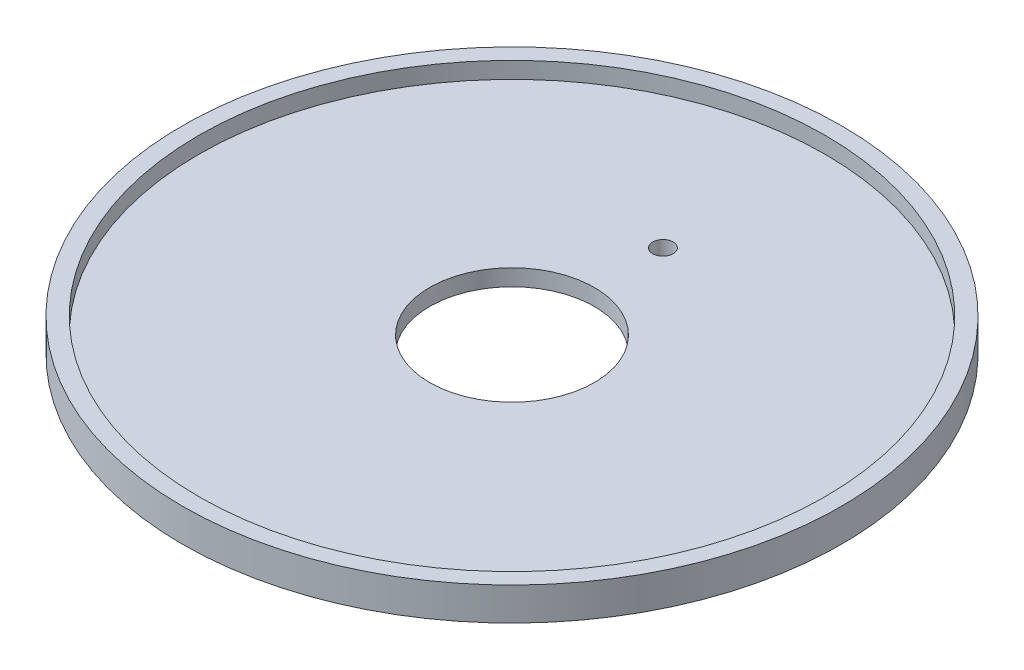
ISO-10303-21;
HEADER;
FILE_DESCRIPTION(('STEP AP214'),'2;1');
FILE_NAME('part.step','',(''),(''),'','','');
FILE_SCHEMA(('AUTOMOTIVE_DESIGN { 1 0 10303 214 1 1 1 1 }'));
ENDSEC;
DATA;
#1=APPLICATION_CONTEXT('core data for automotive mechanical design processes');
#2=APPLICATION_PROTOCOL_DEFINITION('international standard','automotive_design',2000,#1);
#3=PRODUCT_CONTEXT('',#1,'mechanical');
#4=PRODUCT('Part','Part','',(#3));
#5=PRODUCT_RELATED_PRODUCT_CATEGORY('part','',(#4));
#6=PRODUCT_DEFINITION_FORMATION('','',#4);
#7=PRODUCT_DEFINITION_CONTEXT('part definition',#1,'design');
#8=PRODUCT_DEFINITION('design','',#6,#7);
#9=PRODUCT_DEFINITION_SHAPE('','',#8);
#10=(LENGTH_UNIT() NAMED_UNIT(*) SI_UNIT(.MILLI.,.METRE.));
#11=(NAMED_UNIT(*) PLANE_ANGLE_UNIT() SI_UNIT($,.RADIAN.));
#12=(NAMED_UNIT(*) SI_UNIT($,.STERADIAN.) SOLID_ANGLE_UNIT());
#13=UNCERTAINTY_MEASURE_WITH_UNIT(LENGTH_MEASURE(1.E-05),#10,'distance_accuracy_value','');
#14=(GEOMETRIC_REPRESENTATION_CONTEXT(3) GLOBAL_UNCERTAINTY_ASSIGNED_CONTEXT((#13)) GLOBAL_UNIT_ASSIGNED_CONTEXT((#10,
#11,#12)) REPRESENTATION_CONTEXT('',''));
#15=CARTESIAN_POINT('',(0.,0.,0.));
#16=DIRECTION('',(0.,0.,1.));
#17=DIRECTION('',(1.,0.,0.));
#18=AXIS2_PLACEMENT_3D('',#15,#16,#17);
#19=CARTESIAN_POINT('',(0.,5.,0.));
#20=DIRECTION('',(0.,1.,0.));
#21=DIRECTION('',(0.,0.,1.));
#22=AXIS2_PLACEMENT_3D('',#19,#20,#21);
#23=PLANE('',#22);
#24=CARTESIAN_POINT('',(0.,5.,-45.8));
#25=DIRECTION('',(0.,1.,0.));
#26=DIRECTION('',(0.,0.,1.));
#27=AXIS2_PLACEMENT_3D('',#24,#25,#26);
#28=CIRCLE('',#27,3.10140403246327);
#29=CARTESIAN_POINT('',(0.,5.,-42.6985959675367));
#30=VERTEX_POINT('',#29);
#31=EDGE_CURVE('E72',#30,#30,#28,.T.);
#32=ORIENTED_EDGE('',*,*,#31,.F.);
#33=EDGE_LOOP('',(#32));
#34=FACE_BOUND('',#33,.T.);
#35=CARTESIAN_POINT('',(0.,5.,0.));
#36=DIRECTION('',(0.,1.,0.));
#37=DIRECTION('',(0.,0.,1.));
#38=AXIS2_PLACEMENT_3D('',#35,#36,#37);
#39=CIRCLE('',#38,25.);
#40=CARTESIAN_POINT('',(0.,5.,25.));
#41=VERTEX_POINT('',#40);
#42=EDGE_CURVE('E54',#41,#41,#39,.T.);
#43=ORIENTED_EDGE('',*,*,#42,.F.);
#44=EDGE_LOOP('',(#43));
#45=FACE_BOUND('',#44,.T.);
#46=CARTESIAN_POINT('',(0.,5.,0.));
#47=DIRECTION('',(0.,1.,0.));
#48=DIRECTION('',(0.,0.,1.));
#49=AXIS2_PLACEMENT_3D('',#46,#47,#48);
#50=CIRCLE('',#49,95.);
#51=CARTESIAN_POINT('',(0.,5.,95.));
#52=VERTEX_POINT('',#51);
#53=EDGE_CURVE('E10',#52,#52,#50,.F.);
#54=ORIENTED_EDGE('',*,*,#53,.F.);
#55=EDGE_LOOP('',(#54));
#56=FACE_BOUND('',#55,.T.);
#57=ADVANCED_FACE('F40',(#34,#45,#56),#23,.T.);
#58=CARTESIAN_POINT('',(0.,0.,0.));
#59=DIRECTION('',(0.,1.,0.));
#60=DIRECTION('',(0.,0.,1.));
#61=AXIS2_PLACEMENT_3D('',#58,#59,#60);
#62=PLANE('',#61);
#63=CARTESIAN_POINT('',(0.,0.,-45.8));
#64=DIRECTION('',(0.,1.,0.));
#65=DIRECTION('',(0.,0.,1.));
#66=AXIS2_PLACEMENT_3D('',#63,#64,#65);
#67=CIRCLE('',#66,3.10140403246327);
#68=CARTESIAN_POINT('',(0.,0.,-42.6985959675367));
#69=VERTEX_POINT('',#68);
#70=EDGE_CURVE('E44',#69,#69,#67,.T.);
#71=ORIENTED_EDGE('',*,*,#70,.T.);
#72=EDGE_LOOP('',(#71));
#73=FACE_BOUND('',#72,.T.);
#74=CARTESIAN_POINT('',(0.,0.,0.));
#75=DIRECTION('',(0.,1.,0.));
#76=DIRECTION('',(0.,0.,1.));
#77=AXIS2_PLACEMENT_3D('',#74,#75,#76);
#78=CIRCLE('',#77,100.);
#79=CARTESIAN_POINT('',(0.,0.,100.));
#80=VERTEX_POINT('',#79);
#81=EDGE_CURVE('E49',#80,#80,#78,.T.);
#82=ORIENTED_EDGE('',*,*,#81,.F.);
#83=EDGE_LOOP('',(#82));
#84=FACE_BOUND('',#83,.T.);
#85=CARTESIAN_POINT('',(0.,0.,0.));
#86=DIRECTION('',(0.,1.,0.));
#87=DIRECTION('',(0.,0.,1.));
#88=AXIS2_PLACEMENT_3D('',#85,#86,#87);
#89=CIRCLE('',#88,25.);
#90=CARTESIAN_POINT('',(0.,0.,25.));
#91=VERTEX_POINT('',#90);
#92=EDGE_CURVE('E57',#91,#91,#89,.T.);
#93=ORIENTED_EDGE('',*,*,#92,.T.);
#94=EDGE_LOOP('',(#93));
#95=FACE_BOUND('',#94,.T.);
#96=ADVANCED_FACE('F81',(#73,#84,#95),#62,.F.);
#97=CARTESIAN_POINT('',(0.,5.,0.));
#98=DIRECTION('',(0.,-1.,0.));
#99=DIRECTION('',(0.,0.,-1.));
#100=AXIS2_PLACEMENT_3D('',#97,#98,#99);
#101=CYLINDRICAL_SURFACE('',#100,100.);
#102=ORIENTED_EDGE('',*,*,#81,.T.);
#103=EDGE_LOOP('',(#102));
#104=FACE_BOUND('',#103,.T.);
#105=CARTESIAN_POINT('',(0.,10.,0.));
#106=DIRECTION('',(0.,1.,0.));
#107=DIRECTION('',(0.,0.,1.));
#108=AXIS2_PLACEMENT_3D('',#105,#106,#107);
#109=CIRCLE('',#108,100.);
#110=CARTESIAN_POINT('',(0.,10.,100.));
#111=VERTEX_POINT('',#110);
#112=EDGE_CURVE('E61',#111,#111,#109,.T.);
#113=ORIENTED_EDGE('',*,*,#112,.F.);
#114=EDGE_LOOP('',(#113));
#115=FACE_BOUND('',#114,.T.);
#116=ADVANCED_FACE('F42',(#104,#115),#101,.T.);
#117=CARTESIAN_POINT('',(0.,5.,0.));
#118=DIRECTION('',(0.,-1.,0.));
#119=DIRECTION('',(0.,0.,-1.));
#120=AXIS2_PLACEMENT_3D('',#117,#118,#119);
#121=CYLINDRICAL_SURFACE('',#120,25.);
#122=ORIENTED_EDGE('',*,*,#42,.T.);
#123=EDGE_LOOP('',(#122));
#124=FACE_BOUND('',#123,.T.);
#125=ORIENTED_EDGE('',*,*,#92,.F.);
#126=EDGE_LOOP('',(#125));
#127=FACE_BOUND('',#126,.T.);
#128=ADVANCED_FACE('F102',(#124,#127),#121,.F.);
#129=CARTESIAN_POINT('',(0.,10.,0.));
#130=DIRECTION('',(0.,1.,0.));
#131=DIRECTION('',(0.,0.,1.));
#132=AXIS2_PLACEMENT_3D('',#129,#130,#131);
#133=PLANE('',#132);
#134=ORIENTED_EDGE('',*,*,#112,.T.);
#135=EDGE_LOOP('',(#134));
#136=FACE_BOUND('',#135,.T.);
#137=CARTESIAN_POINT('',(0.,10.,0.));
#138=DIRECTION('',(0.,1.,0.));
#139=DIRECTION('',(0.,0.,1.));
#140=AXIS2_PLACEMENT_3D('',#137,#138,#139);
#141=CIRCLE('',#140,95.);
#142=CARTESIAN_POINT('',(0.,10.,95.));
#143=VERTEX_POINT('',#142);
#144=EDGE_CURVE('E68',#143,#143,#141,.T.);
#145=ORIENTED_EDGE('',*,*,#144,.F.);
#146=EDGE_LOOP('',(#145));
#147=FACE_BOUND('',#146,.T.);
#148=ADVANCED_FACE('F91',(#136,#147),#133,.T.);
#149=CARTESIAN_POINT('',(0.,10.,0.));
#150=DIRECTION('',(0.,-1.,0.));
#151=DIRECTION('',(0.,0.,-1.));
#152=AXIS2_PLACEMENT_3D('',#149,#150,#151);
#153=CYLINDRICAL_SURFACE('',#152,95.);
#154=ORIENTED_EDGE('',*,*,#144,.T.);
#155=EDGE_LOOP('',(#154));
#156=FACE_BOUND('',#155,.T.);
#157=ORIENTED_EDGE('',*,*,#53,.T.);
#158=EDGE_LOOP('',(#157));
#159=FACE_BOUND('',#158,.T.);
#160=ADVANCED_FACE('F86',(#156,#159),#153,.F.);
#161=CARTESIAN_POINT('',(0.,-5.,-45.8));
#162=DIRECTION('',(0.,1.,0.));
#163=DIRECTION('',(0.,0.,1.));
#164=AXIS2_PLACEMENT_3D('',#161,#162,#163);
#165=CYLINDRICAL_SURFACE('',#164,3.10140403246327);
#166=ORIENTED_EDGE('',*,*,#31,.T.);
#167=EDGE_LOOP('',(#166));
#168=FACE_BOUND('',#167,.T.);
#169=ORIENTED_EDGE('',*,*,#70,.F.);
#170=EDGE_LOOP('',(#169));
#171=FACE_BOUND('',#170,.T.);
#172=ADVANCED_FACE('F84',(#168,#171),#165,.F.);
#173=CLOSED_SHELL('',(#57,#96,#116,#128,#148,#160,#172));
#174=MANIFOLD_SOLID_BREP('B2',#173);
#175=ADVANCED_BREP_SHAPE_REPRESENTATION('',(#18,#174),#14);
#176=SHAPE_DEFINITION_REPRESENTATION(#9,#175);
ENDSEC;
END-ISO-10303-21;
